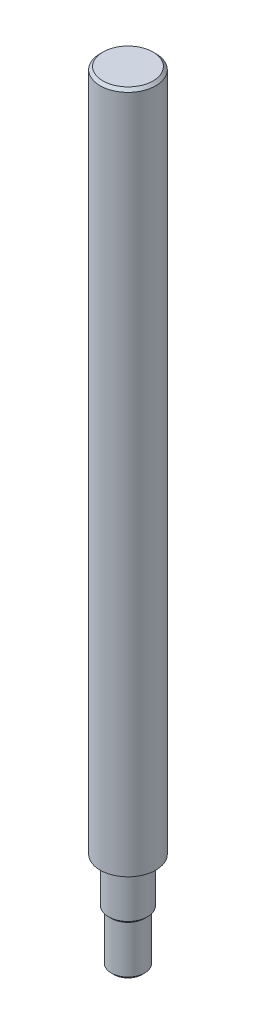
from build123d import *

# Parameters (mm, degrees)
SKETCH_1_R      = 10
EXTRUDE_1_DEPTH = 245
SKETCH_2_R      = 7
EXTRUDE_2_DEPTH = 17
SKETCH_3_R      = 6
EXTRUDE_3_DEPTH = 18
CHAMFER_1_SIZE  = 1
CHAMFER_2_SIZE  = 1
CHAMFER_3_SIZE  = 1


with BuildPart() as part:
    # Sketch 1 → Extrude 1 (new body)
    with BuildSketch(Plane(origin=(0, 0, 0), x_dir=(1, 0, 0), z_dir=(0, 1, 0))):
        with Locations(Location((0, 0, 0), (0, 0, 270))):
            Circle(SKETCH_1_R)
    extrude(amount=EXTRUDE_1_DEPTH)

    # Sketch 2 → Extrude 2 (add)
    with BuildSketch(Plane.XZ):
        with Locations(Location((0, 0, 0), (0, 0, 90))):
            Circle(SKETCH_2_R)
    extrude(amount=EXTRUDE_2_DEPTH)

    # Chamfer 2
    chamfer_2_edges = [part.edges().sort_by_distance(p)[0] for p in [
        (0, -17, -7),
    ]]
    chamfer(chamfer_2_edges, length=CHAMFER_2_SIZE)

    # Chamfer 3
    chamfer_3_edges = [part.edges().sort_by_distance(p)[0] for p in [
        (0, 245, -10),
    ]]
    chamfer(chamfer_3_edges, length=CHAMFER_3_SIZE)


with BuildPart() as body_2:
    # Sketch 3 → Extrude 3 (new body)
    with BuildSketch(Plane.XZ.offset(17)):
        with Locations(Location((0, 0, 0), (0, 0, 270))):
            Circle(SKETCH_3_R)
    extrude(amount=EXTRUDE_3_DEPTH)

    # Chamfer 1
    chamfer_1_edges = [body_2.edges().sort_by_distance(p)[0] for p in [
        (0, -35, 6),
    ]]
    chamfer(chamfer_1_edges, length=CHAMFER_1_SIZE)


solid = Compound([part.part, body_2.part])
